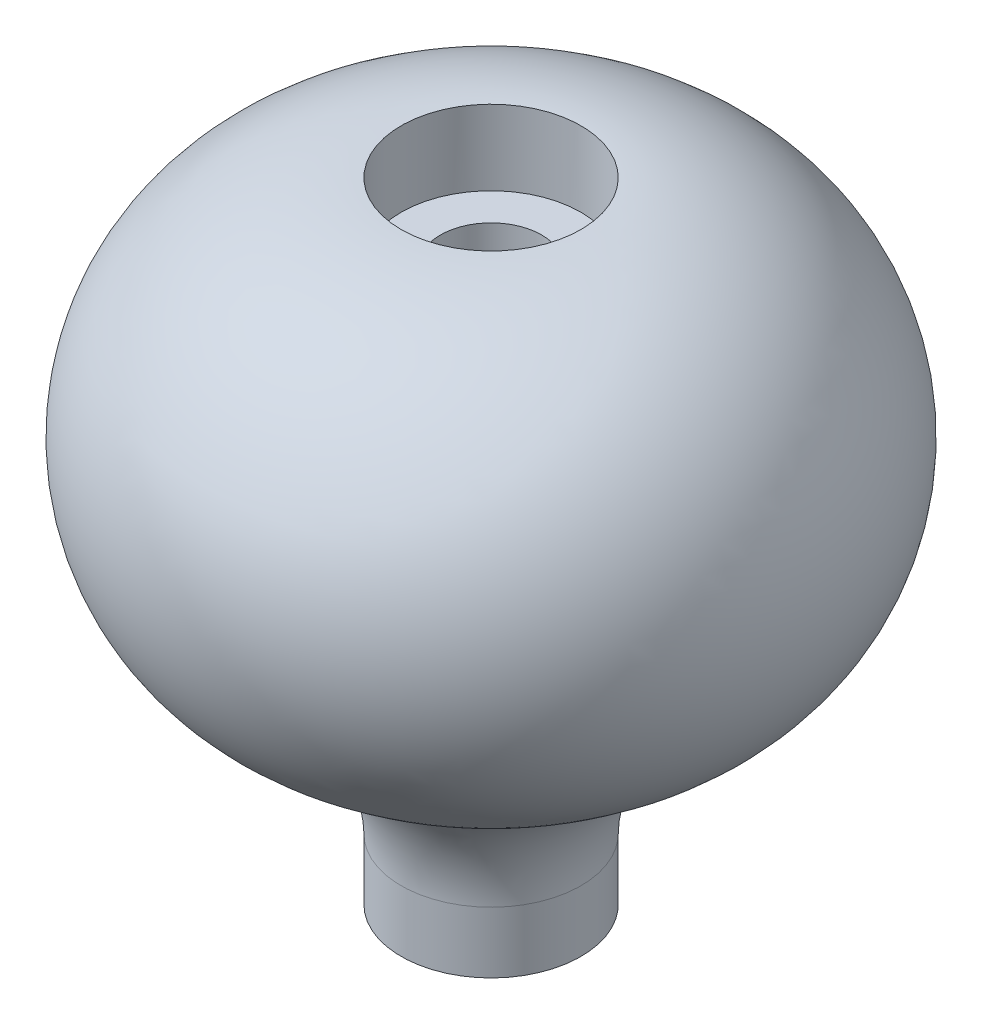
from build123d import *

# Parameters (mm, degrees)
F_1_4_CLEARANCE_HOLE1_D = 6.7564
SKETCH4_R               = 6
CUT_EXTRUDE1_DEPTH      = 5
FILLET1_R               = 10


with BuildPart() as part:
    # Sketch1 → Revolve1 (revolve)
    with BuildSketch(Plane.XY, mode=Mode.PRIVATE) as revolve1_sk:
        with BuildLine():
            Line((0, 0), (6, 0))
            Line((6, 0), (6, 12))
            ThreePointArc((6, 12), (21, 27), (6, 42))
            Line((6, 42), (0, 42))
            Line((0, 42), (0, 0))
        make_face()
    revolve(revolve1_sk.sketch.rotate(Axis((0, 0, 0), (0, 1, 0)), 90), axis=Axis((0, 0, 0), (0, 1, 0)))

    # 1_4 Clearance Hole1 (through all)
    with Locations(Plane(origin=(0, 0, 0), x_dir=(-1, 0, 0), z_dir=(0, -1, 0))):
        with Locations((0, 0)):
            Hole(F_1_4_CLEARANCE_HOLE1_D / 2)

    # Sketch4 → Cut-Extrude1 (cut)
    with BuildSketch(Plane(origin=(0, 42, 0), x_dir=(1, 0, 0), z_dir=(0, 1, 0))):
        with Locations(Location((0, 0, 0), (0, 0, 90))):
            Circle(SKETCH4_R)
    extrude(amount=-CUT_EXTRUDE1_DEPTH, mode=Mode.SUBTRACT)

    # Fillet1
    fillet1_edges = [part.edges().sort_by_distance(p)[0] for p in [
        (0, 12, 6),
    ]]
    fillet(fillet1_edges, radius=FILLET1_R)


solid = part.part
